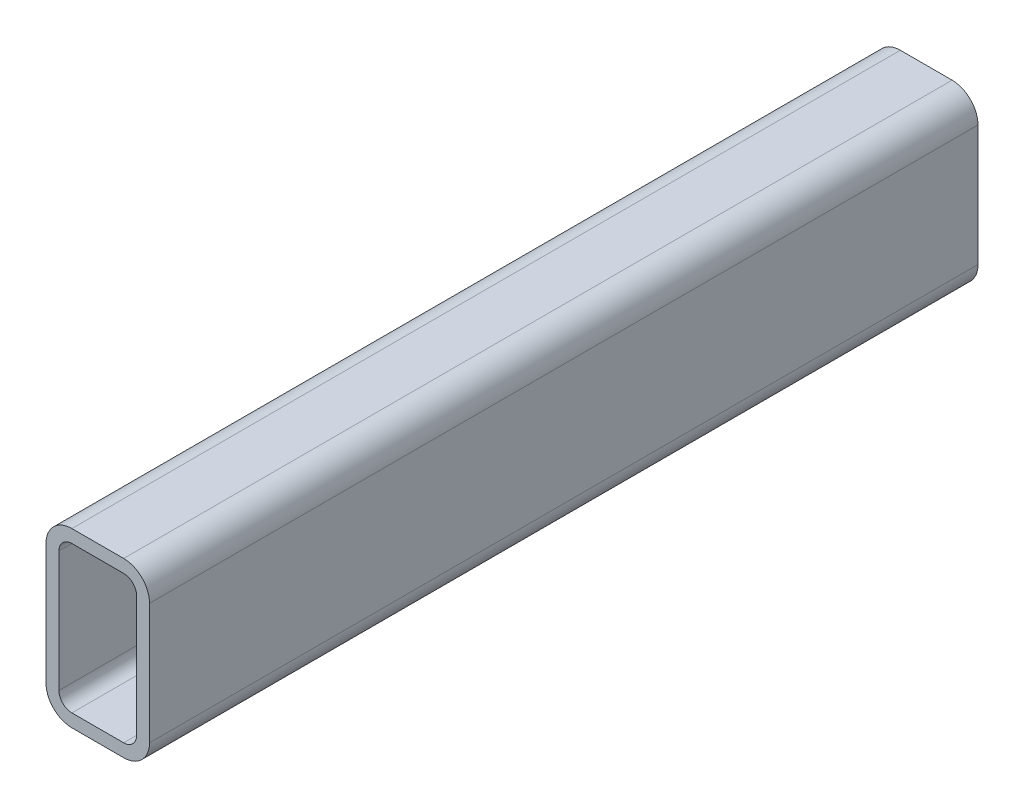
ISO-10303-21;
HEADER;
FILE_DESCRIPTION(('STEP AP214'),'2;1');
FILE_NAME('part.step','',(''),(''),'','','');
FILE_SCHEMA(('AUTOMOTIVE_DESIGN { 1 0 10303 214 1 1 1 1 }'));
ENDSEC;
DATA;
#1=APPLICATION_CONTEXT('core data for automotive mechanical design processes');
#2=APPLICATION_PROTOCOL_DEFINITION('international standard','automotive_design',2000,#1);
#3=PRODUCT_CONTEXT('',#1,'mechanical');
#4=PRODUCT('Part','Part','',(#3));
#5=PRODUCT_RELATED_PRODUCT_CATEGORY('part','',(#4));
#6=PRODUCT_DEFINITION_FORMATION('','',#4);
#7=PRODUCT_DEFINITION_CONTEXT('part definition',#1,'design');
#8=PRODUCT_DEFINITION('design','',#6,#7);
#9=PRODUCT_DEFINITION_SHAPE('','',#8);
#10=(LENGTH_UNIT() NAMED_UNIT(*) SI_UNIT(.MILLI.,.METRE.));
#11=(NAMED_UNIT(*) PLANE_ANGLE_UNIT() SI_UNIT($,.RADIAN.));
#12=(NAMED_UNIT(*) SI_UNIT($,.STERADIAN.) SOLID_ANGLE_UNIT());
#13=UNCERTAINTY_MEASURE_WITH_UNIT(LENGTH_MEASURE(1.E-05),#10,'distance_accuracy_value','');
#14=(GEOMETRIC_REPRESENTATION_CONTEXT(3) GLOBAL_UNCERTAINTY_ASSIGNED_CONTEXT((#13)) GLOBAL_UNIT_ASSIGNED_CONTEXT((#10,
#11,#12)) REPRESENTATION_CONTEXT('',''));
#15=CARTESIAN_POINT('',(0.,0.,0.));
#16=DIRECTION('',(0.,0.,1.));
#17=DIRECTION('',(1.,0.,0.));
#18=AXIS2_PLACEMENT_3D('',#15,#16,#17);
#19=CARTESIAN_POINT('',(9.525,53.975,304.8));
#20=DIRECTION('',(0.,0.,1.));
#21=DIRECTION('',(1.,0.,0.));
#22=AXIS2_PLACEMENT_3D('',#19,#20,#21);
#23=PLANE('',#22);
#24=CARTESIAN_POINT('',(9.525,53.975,304.8));
#25=DIRECTION('',(0.,0.,1.));
#26=DIRECTION('',(1.,0.,0.));
#27=AXIS2_PLACEMENT_3D('',#24,#25,#26);
#28=CIRCLE('',#27,9.525);
#29=CARTESIAN_POINT('',(9.525,63.5,304.8));
#30=VERTEX_POINT('',#29);
#31=CARTESIAN_POINT('',(0.,53.975,304.8));
#32=VERTEX_POINT('',#31);
#33=EDGE_CURVE('E211',#30,#32,#28,.T.);
#34=ORIENTED_EDGE('',*,*,#33,.T.);
#35=DIRECTION('',(0.,-1.,0.));
#36=VECTOR('',#35,1.);
#37=CARTESIAN_POINT('',(0.,9.525,304.8));
#38=LINE('',#37,#36);
#39=CARTESIAN_POINT('',(0.,9.525,304.8));
#40=VERTEX_POINT('',#39);
#41=EDGE_CURVE('E214',#32,#40,#38,.T.);
#42=ORIENTED_EDGE('',*,*,#41,.T.);
#43=CARTESIAN_POINT('',(9.525,9.525,304.8));
#44=DIRECTION('',(0.,0.,1.));
#45=DIRECTION('',(1.,0.,0.));
#46=AXIS2_PLACEMENT_3D('',#43,#44,#45);
#47=CIRCLE('',#46,9.525);
#48=CARTESIAN_POINT('',(9.525,0.,304.8));
#49=VERTEX_POINT('',#48);
#50=EDGE_CURVE('E217',#40,#49,#47,.T.);
#51=ORIENTED_EDGE('',*,*,#50,.T.);
#52=DIRECTION('',(1.,0.,0.));
#53=VECTOR('',#52,1.);
#54=CARTESIAN_POINT('',(28.575,0.,304.8));
#55=LINE('',#54,#53);
#56=CARTESIAN_POINT('',(28.575,0.,304.8));
#57=VERTEX_POINT('',#56);
#58=EDGE_CURVE('E219',#49,#57,#55,.T.);
#59=ORIENTED_EDGE('',*,*,#58,.T.);
#60=CARTESIAN_POINT('',(28.575,9.525,304.8));
#61=DIRECTION('',(0.,0.,1.));
#62=DIRECTION('',(1.,0.,0.));
#63=AXIS2_PLACEMENT_3D('',#60,#61,#62);
#64=CIRCLE('',#63,9.525);
#65=CARTESIAN_POINT('',(38.1,9.525,304.8));
#66=VERTEX_POINT('',#65);
#67=EDGE_CURVE('E221',#57,#66,#64,.T.);
#68=ORIENTED_EDGE('',*,*,#67,.T.);
#69=DIRECTION('',(0.,1.,0.));
#70=VECTOR('',#69,1.);
#71=CARTESIAN_POINT('',(38.1,53.975,304.8));
#72=LINE('',#71,#70);
#73=CARTESIAN_POINT('',(38.1,53.975,304.8));
#74=VERTEX_POINT('',#73);
#75=EDGE_CURVE('E223',#66,#74,#72,.T.);
#76=ORIENTED_EDGE('',*,*,#75,.T.);
#77=CARTESIAN_POINT('',(28.575,53.975,304.8));
#78=DIRECTION('',(0.,0.,1.));
#79=DIRECTION('',(1.,0.,0.));
#80=AXIS2_PLACEMENT_3D('',#77,#78,#79);
#81=CIRCLE('',#80,9.525);
#82=CARTESIAN_POINT('',(28.575,63.5,304.8));
#83=VERTEX_POINT('',#82);
#84=EDGE_CURVE('E225',#74,#83,#81,.T.);
#85=ORIENTED_EDGE('',*,*,#84,.T.);
#86=DIRECTION('',(-1.,0.,0.));
#87=VECTOR('',#86,1.);
#88=CARTESIAN_POINT('',(9.525,63.5,304.8));
#89=LINE('',#88,#87);
#90=EDGE_CURVE('E227',#83,#30,#89,.T.);
#91=ORIENTED_EDGE('',*,*,#90,.T.);
#92=EDGE_LOOP('',(#34,#42,#51,#59,#68,#76,#85,#91));
#93=FACE_BOUND('',#92,.T.);
#94=DIRECTION('',(0.,-1.,0.));
#95=VECTOR('',#94,1.);
#96=CARTESIAN_POINT('',(4.7625,9.525,304.8));
#97=LINE('',#96,#95);
#98=CARTESIAN_POINT('',(4.7625,53.975,304.8));
#99=VERTEX_POINT('',#98);
#100=CARTESIAN_POINT('',(4.7625,9.525,304.8));
#101=VERTEX_POINT('',#100);
#102=EDGE_CURVE('E154',#99,#101,#97,.T.);
#103=ORIENTED_EDGE('',*,*,#102,.F.);
#104=CARTESIAN_POINT('',(9.525,53.975,304.8));
#105=DIRECTION('',(0.,0.,1.));
#106=DIRECTION('',(1.,0.,0.));
#107=AXIS2_PLACEMENT_3D('',#104,#105,#106);
#108=CIRCLE('',#107,4.76249999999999);
#109=CARTESIAN_POINT('',(9.525,58.7375,304.8));
#110=VERTEX_POINT('',#109);
#111=EDGE_CURVE('E146',#110,#99,#108,.T.);
#112=ORIENTED_EDGE('',*,*,#111,.F.);
#113=DIRECTION('',(-1.,0.,0.));
#114=VECTOR('',#113,1.);
#115=CARTESIAN_POINT('',(9.525,58.7375,304.8));
#116=LINE('',#115,#114);
#117=CARTESIAN_POINT('',(28.575,58.7375,304.8));
#118=VERTEX_POINT('',#117);
#119=EDGE_CURVE('E179',#118,#110,#116,.T.);
#120=ORIENTED_EDGE('',*,*,#119,.F.);
#121=CARTESIAN_POINT('',(28.575,53.975,304.8));
#122=DIRECTION('',(0.,0.,1.));
#123=DIRECTION('',(1.,0.,0.));
#124=AXIS2_PLACEMENT_3D('',#121,#122,#123);
#125=CIRCLE('',#124,4.76249999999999);
#126=CARTESIAN_POINT('',(33.3375,53.975,304.8));
#127=VERTEX_POINT('',#126);
#128=EDGE_CURVE('E177',#127,#118,#125,.T.);
#129=ORIENTED_EDGE('',*,*,#128,.F.);
#130=DIRECTION('',(0.,1.,0.));
#131=VECTOR('',#130,1.);
#132=CARTESIAN_POINT('',(33.3375,53.975,304.8));
#133=LINE('',#132,#131);
#134=CARTESIAN_POINT('',(33.3375,9.525,304.8));
#135=VERTEX_POINT('',#134);
#136=EDGE_CURVE('E175',#135,#127,#133,.T.);
#137=ORIENTED_EDGE('',*,*,#136,.F.);
#138=CARTESIAN_POINT('',(28.575,9.525,304.8));
#139=DIRECTION('',(0.,0.,1.));
#140=DIRECTION('',(1.,0.,0.));
#141=AXIS2_PLACEMENT_3D('',#138,#139,#140);
#142=CIRCLE('',#141,4.7625);
#143=CARTESIAN_POINT('',(28.575,4.7625,304.8));
#144=VERTEX_POINT('',#143);
#145=EDGE_CURVE('E173',#144,#135,#142,.T.);
#146=ORIENTED_EDGE('',*,*,#145,.F.);
#147=DIRECTION('',(1.,0.,0.));
#148=VECTOR('',#147,1.);
#149=CARTESIAN_POINT('',(28.575,4.7625,304.8));
#150=LINE('',#149,#148);
#151=CARTESIAN_POINT('',(9.525,4.7625,304.8));
#152=VERTEX_POINT('',#151);
#153=EDGE_CURVE('E169',#152,#144,#150,.T.);
#154=ORIENTED_EDGE('',*,*,#153,.F.);
#155=CARTESIAN_POINT('',(9.525,9.525,304.8));
#156=DIRECTION('',(0.,0.,1.));
#157=DIRECTION('',(1.,0.,0.));
#158=AXIS2_PLACEMENT_3D('',#155,#156,#157);
#159=CIRCLE('',#158,4.7625);
#160=EDGE_CURVE('E167',#101,#152,#159,.T.);
#161=ORIENTED_EDGE('',*,*,#160,.F.);
#162=EDGE_LOOP('',(#103,#112,#120,#129,#137,#146,#154,#161));
#163=FACE_BOUND('',#162,.T.);
#164=ADVANCED_FACE('F33',(#93,#163),#23,.T.);
#165=CARTESIAN_POINT('',(9.525,53.975,0.));
#166=DIRECTION('',(0.,0.,1.));
#167=DIRECTION('',(1.,0.,0.));
#168=AXIS2_PLACEMENT_3D('',#165,#166,#167);
#169=PLANE('',#168);
#170=CARTESIAN_POINT('',(9.525,53.975,0.));
#171=DIRECTION('',(0.,0.,1.));
#172=DIRECTION('',(1.,0.,0.));
#173=AXIS2_PLACEMENT_3D('',#170,#171,#172);
#174=CIRCLE('',#173,9.525);
#175=CARTESIAN_POINT('',(9.525,63.5,0.));
#176=VERTEX_POINT('',#175);
#177=CARTESIAN_POINT('',(0.,53.975,0.));
#178=VERTEX_POINT('',#177);
#179=EDGE_CURVE('E162',#176,#178,#174,.T.);
#180=ORIENTED_EDGE('',*,*,#179,.F.);
#181=DIRECTION('',(-1.,0.,0.));
#182=VECTOR('',#181,1.);
#183=CARTESIAN_POINT('',(9.525,63.5,0.));
#184=LINE('',#183,#182);
#185=CARTESIAN_POINT('',(28.575,63.5,0.));
#186=VERTEX_POINT('',#185);
#187=EDGE_CURVE('E215',#186,#176,#184,.T.);
#188=ORIENTED_EDGE('',*,*,#187,.F.);
#189=CARTESIAN_POINT('',(28.575,53.975,0.));
#190=DIRECTION('',(0.,0.,1.));
#191=DIRECTION('',(1.,0.,0.));
#192=AXIS2_PLACEMENT_3D('',#189,#190,#191);
#193=CIRCLE('',#192,9.525);
#194=CARTESIAN_POINT('',(38.1,53.975,0.));
#195=VERTEX_POINT('',#194);
#196=EDGE_CURVE('E242',#195,#186,#193,.T.);
#197=ORIENTED_EDGE('',*,*,#196,.F.);
#198=DIRECTION('',(0.,1.,0.));
#199=VECTOR('',#198,1.);
#200=CARTESIAN_POINT('',(38.1,53.975,0.));
#201=LINE('',#200,#199);
#202=CARTESIAN_POINT('',(38.1,9.525,0.));
#203=VERTEX_POINT('',#202);
#204=EDGE_CURVE('E240',#203,#195,#201,.T.);
#205=ORIENTED_EDGE('',*,*,#204,.F.);
#206=CARTESIAN_POINT('',(28.575,9.525,0.));
#207=DIRECTION('',(0.,0.,1.));
#208=DIRECTION('',(1.,0.,0.));
#209=AXIS2_PLACEMENT_3D('',#206,#207,#208);
#210=CIRCLE('',#209,9.525);
#211=CARTESIAN_POINT('',(28.575,0.,0.));
#212=VERTEX_POINT('',#211);
#213=EDGE_CURVE('E238',#212,#203,#210,.T.);
#214=ORIENTED_EDGE('',*,*,#213,.F.);
#215=DIRECTION('',(1.,0.,0.));
#216=VECTOR('',#215,1.);
#217=CARTESIAN_POINT('',(28.575,0.,0.));
#218=LINE('',#217,#216);
#219=CARTESIAN_POINT('',(9.525,0.,0.));
#220=VERTEX_POINT('',#219);
#221=EDGE_CURVE('E236',#220,#212,#218,.T.);
#222=ORIENTED_EDGE('',*,*,#221,.F.);
#223=CARTESIAN_POINT('',(9.525,9.525,0.));
#224=DIRECTION('',(0.,0.,1.));
#225=DIRECTION('',(1.,0.,0.));
#226=AXIS2_PLACEMENT_3D('',#223,#224,#225);
#227=CIRCLE('',#226,9.525);
#228=CARTESIAN_POINT('',(0.,9.525,0.));
#229=VERTEX_POINT('',#228);
#230=EDGE_CURVE('E234',#229,#220,#227,.T.);
#231=ORIENTED_EDGE('',*,*,#230,.F.);
#232=DIRECTION('',(0.,-1.,0.));
#233=VECTOR('',#232,1.);
#234=CARTESIAN_POINT('',(0.,9.525,0.));
#235=LINE('',#234,#233);
#236=EDGE_CURVE('E232',#178,#229,#235,.T.);
#237=ORIENTED_EDGE('',*,*,#236,.F.);
#238=EDGE_LOOP('',(#180,#188,#197,#205,#214,#222,#231,#237));
#239=FACE_BOUND('',#238,.T.);
#240=CARTESIAN_POINT('',(9.525,53.975,0.));
#241=DIRECTION('',(0.,0.,1.));
#242=DIRECTION('',(1.,0.,0.));
#243=AXIS2_PLACEMENT_3D('',#240,#241,#242);
#244=CIRCLE('',#243,4.76249999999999);
#245=CARTESIAN_POINT('',(9.525,58.7375,0.));
#246=VERTEX_POINT('',#245);
#247=CARTESIAN_POINT('',(4.7625,53.975,0.));
#248=VERTEX_POINT('',#247);
#249=EDGE_CURVE('E56',#246,#248,#244,.T.);
#250=ORIENTED_EDGE('',*,*,#249,.T.);
#251=DIRECTION('',(0.,-1.,0.));
#252=VECTOR('',#251,1.);
#253=CARTESIAN_POINT('',(4.7625,9.525,0.));
#254=LINE('',#253,#252);
#255=CARTESIAN_POINT('',(4.7625,9.525,0.));
#256=VERTEX_POINT('',#255);
#257=EDGE_CURVE('E161',#248,#256,#254,.T.);
#258=ORIENTED_EDGE('',*,*,#257,.T.);
#259=CARTESIAN_POINT('',(9.525,9.525,0.));
#260=DIRECTION('',(0.,0.,1.));
#261=DIRECTION('',(1.,0.,0.));
#262=AXIS2_PLACEMENT_3D('',#259,#260,#261);
#263=CIRCLE('',#262,4.7625);
#264=CARTESIAN_POINT('',(9.525,4.7625,0.));
#265=VERTEX_POINT('',#264);
#266=EDGE_CURVE('E183',#256,#265,#263,.T.);
#267=ORIENTED_EDGE('',*,*,#266,.T.);
#268=DIRECTION('',(1.,0.,0.));
#269=VECTOR('',#268,1.);
#270=CARTESIAN_POINT('',(28.575,4.7625,0.));
#271=LINE('',#270,#269);
#272=CARTESIAN_POINT('',(28.575,4.7625,0.));
#273=VERTEX_POINT('',#272);
#274=EDGE_CURVE('E186',#265,#273,#271,.T.);
#275=ORIENTED_EDGE('',*,*,#274,.T.);
#276=CARTESIAN_POINT('',(28.575,9.525,0.));
#277=DIRECTION('',(0.,0.,1.));
#278=DIRECTION('',(1.,0.,0.));
#279=AXIS2_PLACEMENT_3D('',#276,#277,#278);
#280=CIRCLE('',#279,4.7625);
#281=CARTESIAN_POINT('',(33.3375,9.525,0.));
#282=VERTEX_POINT('',#281);
#283=EDGE_CURVE('E189',#273,#282,#280,.T.);
#284=ORIENTED_EDGE('',*,*,#283,.T.);
#285=DIRECTION('',(0.,1.,0.));
#286=VECTOR('',#285,1.);
#287=CARTESIAN_POINT('',(33.3375,53.975,0.));
#288=LINE('',#287,#286);
#289=CARTESIAN_POINT('',(33.3375,53.975,0.));
#290=VERTEX_POINT('',#289);
#291=EDGE_CURVE('E192',#282,#290,#288,.T.);
#292=ORIENTED_EDGE('',*,*,#291,.T.);
#293=CARTESIAN_POINT('',(28.575,53.975,0.));
#294=DIRECTION('',(0.,0.,1.));
#295=DIRECTION('',(1.,0.,0.));
#296=AXIS2_PLACEMENT_3D('',#293,#294,#295);
#297=CIRCLE('',#296,4.76249999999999);
#298=CARTESIAN_POINT('',(28.575,58.7375,0.));
#299=VERTEX_POINT('',#298);
#300=EDGE_CURVE('E195',#290,#299,#297,.T.);
#301=ORIENTED_EDGE('',*,*,#300,.T.);
#302=DIRECTION('',(-1.,0.,0.));
#303=VECTOR('',#302,1.);
#304=CARTESIAN_POINT('',(9.525,58.7375,0.));
#305=LINE('',#304,#303);
#306=EDGE_CURVE('E155',#299,#246,#305,.T.);
#307=ORIENTED_EDGE('',*,*,#306,.T.);
#308=EDGE_LOOP('',(#250,#258,#267,#275,#284,#292,#301,#307));
#309=FACE_BOUND('',#308,.T.);
#310=ADVANCED_FACE('F272',(#239,#309),#169,.F.);
#311=CARTESIAN_POINT('',(9.525,53.975,304.8));
#312=DIRECTION('',(0.,0.,-1.));
#313=DIRECTION('',(-1.,0.,0.));
#314=AXIS2_PLACEMENT_3D('',#311,#312,#313);
#315=CYLINDRICAL_SURFACE('',#314,9.525);
#316=ORIENTED_EDGE('',*,*,#179,.T.);
#317=DIRECTION('',(0.,0.,-1.));
#318=VECTOR('',#317,1.);
#319=CARTESIAN_POINT('',(0.,53.975,304.8));
#320=LINE('',#319,#318);
#321=EDGE_CURVE('E11',#32,#178,#320,.T.);
#322=ORIENTED_EDGE('',*,*,#321,.F.);
#323=ORIENTED_EDGE('',*,*,#33,.F.);
#324=DIRECTION('',(0.,0.,-1.));
#325=VECTOR('',#324,1.);
#326=CARTESIAN_POINT('',(9.525,63.5,304.8));
#327=LINE('',#326,#325);
#328=EDGE_CURVE('E229',#30,#176,#327,.T.);
#329=ORIENTED_EDGE('',*,*,#328,.T.);
#330=EDGE_LOOP('',(#316,#322,#323,#329));
#331=FACE_BOUND('',#330,.T.);
#332=ADVANCED_FACE('F35',(#331),#315,.T.);
#333=CARTESIAN_POINT('',(0.,9.525,304.8));
#334=DIRECTION('',(1.,0.,0.));
#335=DIRECTION('',(0.,0.,-1.));
#336=AXIS2_PLACEMENT_3D('',#333,#334,#335);
#337=PLANE('',#336);
#338=ORIENTED_EDGE('',*,*,#236,.T.);
#339=DIRECTION('',(0.,0.,-1.));
#340=VECTOR('',#339,1.);
#341=CARTESIAN_POINT('',(0.,9.525,304.8));
#342=LINE('',#341,#340);
#343=EDGE_CURVE('E41',#40,#229,#342,.T.);
#344=ORIENTED_EDGE('',*,*,#343,.F.);
#345=ORIENTED_EDGE('',*,*,#41,.F.);
#346=ORIENTED_EDGE('',*,*,#321,.T.);
#347=EDGE_LOOP('',(#338,#344,#345,#346));
#348=FACE_BOUND('',#347,.T.);
#349=ADVANCED_FACE('F289',(#348),#337,.F.);
#350=CARTESIAN_POINT('',(9.525,9.525,304.8));
#351=DIRECTION('',(0.,0.,-1.));
#352=DIRECTION('',(-1.,0.,0.));
#353=AXIS2_PLACEMENT_3D('',#350,#351,#352);
#354=CYLINDRICAL_SURFACE('',#353,9.525);
#355=ORIENTED_EDGE('',*,*,#230,.T.);
#356=DIRECTION('',(0.,0.,-1.));
#357=VECTOR('',#356,1.);
#358=CARTESIAN_POINT('',(9.525,0.,304.8));
#359=LINE('',#358,#357);
#360=EDGE_CURVE('E259',#49,#220,#359,.T.);
#361=ORIENTED_EDGE('',*,*,#360,.F.);
#362=ORIENTED_EDGE('',*,*,#50,.F.);
#363=ORIENTED_EDGE('',*,*,#343,.T.);
#364=EDGE_LOOP('',(#355,#361,#362,#363));
#365=FACE_BOUND('',#364,.T.);
#366=ADVANCED_FACE('F266',(#365),#354,.T.);
#367=CARTESIAN_POINT('',(28.575,0.,304.8));
#368=DIRECTION('',(0.,1.,0.));
#369=DIRECTION('',(0.,0.,1.));
#370=AXIS2_PLACEMENT_3D('',#367,#368,#369);
#371=PLANE('',#370);
#372=ORIENTED_EDGE('',*,*,#221,.T.);
#373=DIRECTION('',(0.,0.,-1.));
#374=VECTOR('',#373,1.);
#375=CARTESIAN_POINT('',(28.575,0.,304.8));
#376=LINE('',#375,#374);
#377=EDGE_CURVE('E256',#57,#212,#376,.T.);
#378=ORIENTED_EDGE('',*,*,#377,.F.);
#379=ORIENTED_EDGE('',*,*,#58,.F.);
#380=ORIENTED_EDGE('',*,*,#360,.T.);
#381=EDGE_LOOP('',(#372,#378,#379,#380));
#382=FACE_BOUND('',#381,.T.);
#383=ADVANCED_FACE('F278',(#382),#371,.F.);
#384=CARTESIAN_POINT('',(28.575,9.525,304.8));
#385=DIRECTION('',(0.,0.,-1.));
#386=DIRECTION('',(-1.,0.,0.));
#387=AXIS2_PLACEMENT_3D('',#384,#385,#386);
#388=CYLINDRICAL_SURFACE('',#387,9.525);
#389=ORIENTED_EDGE('',*,*,#213,.T.);
#390=DIRECTION('',(0.,0.,-1.));
#391=VECTOR('',#390,1.);
#392=CARTESIAN_POINT('',(38.1,9.525,304.8));
#393=LINE('',#392,#391);
#394=EDGE_CURVE('E253',#66,#203,#393,.T.);
#395=ORIENTED_EDGE('',*,*,#394,.F.);
#396=ORIENTED_EDGE('',*,*,#67,.F.);
#397=ORIENTED_EDGE('',*,*,#377,.T.);
#398=EDGE_LOOP('',(#389,#395,#396,#397));
#399=FACE_BOUND('',#398,.T.);
#400=ADVANCED_FACE('F282',(#399),#388,.T.);
#401=CARTESIAN_POINT('',(38.1,53.975,304.8));
#402=DIRECTION('',(-1.,0.,0.));
#403=DIRECTION('',(0.,0.,1.));
#404=AXIS2_PLACEMENT_3D('',#401,#402,#403);
#405=PLANE('',#404);
#406=ORIENTED_EDGE('',*,*,#204,.T.);
#407=DIRECTION('',(0.,0.,-1.));
#408=VECTOR('',#407,1.);
#409=CARTESIAN_POINT('',(38.1,53.975,304.8));
#410=LINE('',#409,#408);
#411=EDGE_CURVE('E250',#74,#195,#410,.T.);
#412=ORIENTED_EDGE('',*,*,#411,.F.);
#413=ORIENTED_EDGE('',*,*,#75,.F.);
#414=ORIENTED_EDGE('',*,*,#394,.T.);
#415=EDGE_LOOP('',(#406,#412,#413,#414));
#416=FACE_BOUND('',#415,.T.);
#417=ADVANCED_FACE('F302',(#416),#405,.F.);
#418=CARTESIAN_POINT('',(28.575,53.975,304.8));
#419=DIRECTION('',(0.,0.,-1.));
#420=DIRECTION('',(-1.,0.,0.));
#421=AXIS2_PLACEMENT_3D('',#418,#419,#420);
#422=CYLINDRICAL_SURFACE('',#421,9.525);
#423=ORIENTED_EDGE('',*,*,#196,.T.);
#424=DIRECTION('',(0.,0.,-1.));
#425=VECTOR('',#424,1.);
#426=CARTESIAN_POINT('',(28.575,63.5,304.8));
#427=LINE('',#426,#425);
#428=EDGE_CURVE('E247',#83,#186,#427,.T.);
#429=ORIENTED_EDGE('',*,*,#428,.F.);
#430=ORIENTED_EDGE('',*,*,#84,.F.);
#431=ORIENTED_EDGE('',*,*,#411,.T.);
#432=EDGE_LOOP('',(#423,#429,#430,#431));
#433=FACE_BOUND('',#432,.T.);
#434=ADVANCED_FACE('F300',(#433),#422,.T.);
#435=CARTESIAN_POINT('',(9.525,63.5,304.8));
#436=DIRECTION('',(0.,-1.,0.));
#437=DIRECTION('',(0.,0.,-1.));
#438=AXIS2_PLACEMENT_3D('',#435,#436,#437);
#439=PLANE('',#438);
#440=ORIENTED_EDGE('',*,*,#187,.T.);
#441=ORIENTED_EDGE('',*,*,#328,.F.);
#442=ORIENTED_EDGE('',*,*,#90,.F.);
#443=ORIENTED_EDGE('',*,*,#428,.T.);
#444=EDGE_LOOP('',(#440,#441,#442,#443));
#445=FACE_BOUND('',#444,.T.);
#446=ADVANCED_FACE('F295',(#445),#439,.F.);
#447=CARTESIAN_POINT('',(9.525,53.975,304.8));
#448=DIRECTION('',(0.,0.,-1.));
#449=DIRECTION('',(-1.,0.,0.));
#450=AXIS2_PLACEMENT_3D('',#447,#448,#449);
#451=CYLINDRICAL_SURFACE('',#450,4.76249999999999);
#452=ORIENTED_EDGE('',*,*,#249,.F.);
#453=DIRECTION('',(0.,0.,-1.));
#454=VECTOR('',#453,1.);
#455=CARTESIAN_POINT('',(9.525,58.7375,304.8));
#456=LINE('',#455,#454);
#457=EDGE_CURVE('E150',#110,#246,#456,.T.);
#458=ORIENTED_EDGE('',*,*,#457,.F.);
#459=ORIENTED_EDGE('',*,*,#111,.T.);
#460=DIRECTION('',(0.,0.,-1.));
#461=VECTOR('',#460,1.);
#462=CARTESIAN_POINT('',(4.7625,53.975,304.8));
#463=LINE('',#462,#461);
#464=EDGE_CURVE('E149',#99,#248,#463,.T.);
#465=ORIENTED_EDGE('',*,*,#464,.T.);
#466=EDGE_LOOP('',(#452,#458,#459,#465));
#467=FACE_BOUND('',#466,.T.);
#468=ADVANCED_FACE('F148',(#467),#451,.F.);
#469=CARTESIAN_POINT('',(4.7625,9.525,304.8));
#470=DIRECTION('',(1.,0.,0.));
#471=DIRECTION('',(0.,0.,-1.));
#472=AXIS2_PLACEMENT_3D('',#469,#470,#471);
#473=PLANE('',#472);
#474=ORIENTED_EDGE('',*,*,#257,.F.);
#475=ORIENTED_EDGE('',*,*,#464,.F.);
#476=ORIENTED_EDGE('',*,*,#102,.T.);
#477=DIRECTION('',(0.,0.,-1.));
#478=VECTOR('',#477,1.);
#479=CARTESIAN_POINT('',(4.7625,9.525,304.8));
#480=LINE('',#479,#478);
#481=EDGE_CURVE('E163',#101,#256,#480,.T.);
#482=ORIENTED_EDGE('',*,*,#481,.T.);
#483=EDGE_LOOP('',(#474,#475,#476,#482));
#484=FACE_BOUND('',#483,.T.);
#485=ADVANCED_FACE('F158',(#484),#473,.T.);
#486=CARTESIAN_POINT('',(9.525,9.525,304.8));
#487=DIRECTION('',(0.,0.,-1.));
#488=DIRECTION('',(-1.,0.,0.));
#489=AXIS2_PLACEMENT_3D('',#486,#487,#488);
#490=CYLINDRICAL_SURFACE('',#489,4.7625);
#491=ORIENTED_EDGE('',*,*,#266,.F.);
#492=ORIENTED_EDGE('',*,*,#481,.F.);
#493=ORIENTED_EDGE('',*,*,#160,.T.);
#494=DIRECTION('',(0.,0.,-1.));
#495=VECTOR('',#494,1.);
#496=CARTESIAN_POINT('',(9.525,4.7625,304.8));
#497=LINE('',#496,#495);
#498=EDGE_CURVE('E208',#152,#265,#497,.T.);
#499=ORIENTED_EDGE('',*,*,#498,.T.);
#500=EDGE_LOOP('',(#491,#492,#493,#499));
#501=FACE_BOUND('',#500,.T.);
#502=ADVANCED_FACE('F327',(#501),#490,.F.);
#503=CARTESIAN_POINT('',(28.575,4.7625,304.8));
#504=DIRECTION('',(0.,1.,0.));
#505=DIRECTION('',(0.,0.,1.));
#506=AXIS2_PLACEMENT_3D('',#503,#504,#505);
#507=PLANE('',#506);
#508=ORIENTED_EDGE('',*,*,#274,.F.);
#509=ORIENTED_EDGE('',*,*,#498,.F.);
#510=ORIENTED_EDGE('',*,*,#153,.T.);
#511=DIRECTION('',(0.,0.,-1.));
#512=VECTOR('',#511,1.);
#513=CARTESIAN_POINT('',(28.575,4.7625,304.8));
#514=LINE('',#513,#512);
#515=EDGE_CURVE('E206',#144,#273,#514,.T.);
#516=ORIENTED_EDGE('',*,*,#515,.T.);
#517=EDGE_LOOP('',(#508,#509,#510,#516));
#518=FACE_BOUND('',#517,.T.);
#519=ADVANCED_FACE('F331',(#518),#507,.T.);
#520=CARTESIAN_POINT('',(28.575,9.525,304.8));
#521=DIRECTION('',(0.,0.,-1.));
#522=DIRECTION('',(-1.,0.,0.));
#523=AXIS2_PLACEMENT_3D('',#520,#521,#522);
#524=CYLINDRICAL_SURFACE('',#523,4.7625);
#525=ORIENTED_EDGE('',*,*,#283,.F.);
#526=ORIENTED_EDGE('',*,*,#515,.F.);
#527=ORIENTED_EDGE('',*,*,#145,.T.);
#528=DIRECTION('',(0.,0.,-1.));
#529=VECTOR('',#528,1.);
#530=CARTESIAN_POINT('',(33.3375,9.525,304.8));
#531=LINE('',#530,#529);
#532=EDGE_CURVE('E204',#135,#282,#531,.T.);
#533=ORIENTED_EDGE('',*,*,#532,.T.);
#534=EDGE_LOOP('',(#525,#526,#527,#533));
#535=FACE_BOUND('',#534,.T.);
#536=ADVANCED_FACE('F337',(#535),#524,.F.);
#537=CARTESIAN_POINT('',(33.3375,53.975,304.8));
#538=DIRECTION('',(-1.,0.,0.));
#539=DIRECTION('',(0.,0.,1.));
#540=AXIS2_PLACEMENT_3D('',#537,#538,#539);
#541=PLANE('',#540);
#542=ORIENTED_EDGE('',*,*,#291,.F.);
#543=ORIENTED_EDGE('',*,*,#532,.F.);
#544=ORIENTED_EDGE('',*,*,#136,.T.);
#545=DIRECTION('',(0.,0.,-1.));
#546=VECTOR('',#545,1.);
#547=CARTESIAN_POINT('',(33.3375,53.975,304.8));
#548=LINE('',#547,#546);
#549=EDGE_CURVE('E202',#127,#290,#548,.T.);
#550=ORIENTED_EDGE('',*,*,#549,.T.);
#551=EDGE_LOOP('',(#542,#543,#544,#550));
#552=FACE_BOUND('',#551,.T.);
#553=ADVANCED_FACE('F341',(#552),#541,.T.);
#554=CARTESIAN_POINT('',(28.575,53.975,304.8));
#555=DIRECTION('',(0.,0.,-1.));
#556=DIRECTION('',(-1.,0.,0.));
#557=AXIS2_PLACEMENT_3D('',#554,#555,#556);
#558=CYLINDRICAL_SURFACE('',#557,4.76249999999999);
#559=ORIENTED_EDGE('',*,*,#300,.F.);
#560=ORIENTED_EDGE('',*,*,#549,.F.);
#561=ORIENTED_EDGE('',*,*,#128,.T.);
#562=DIRECTION('',(0.,0.,-1.));
#563=VECTOR('',#562,1.);
#564=CARTESIAN_POINT('',(28.575,58.7375,304.8));
#565=LINE('',#564,#563);
#566=EDGE_CURVE('E48',#118,#299,#565,.T.);
#567=ORIENTED_EDGE('',*,*,#566,.T.);
#568=EDGE_LOOP('',(#559,#560,#561,#567));
#569=FACE_BOUND('',#568,.T.);
#570=ADVANCED_FACE('F345',(#569),#558,.F.);
#571=CARTESIAN_POINT('',(9.525,58.7375,304.8));
#572=DIRECTION('',(0.,-1.,0.));
#573=DIRECTION('',(0.,0.,-1.));
#574=AXIS2_PLACEMENT_3D('',#571,#572,#573);
#575=PLANE('',#574);
#576=ORIENTED_EDGE('',*,*,#306,.F.);
#577=ORIENTED_EDGE('',*,*,#566,.F.);
#578=ORIENTED_EDGE('',*,*,#119,.T.);
#579=ORIENTED_EDGE('',*,*,#457,.T.);
#580=EDGE_LOOP('',(#576,#577,#578,#579));
#581=FACE_BOUND('',#580,.T.);
#582=ADVANCED_FACE('F349',(#581),#575,.T.);
#583=CLOSED_SHELL('',(#164,#310,#332,#349,#366,#383,#400,#417,#434,#446,#468,#485,#502,#519,
#536,#553,#570,#582));
#584=MANIFOLD_SOLID_BREP('B2',#583);
#585=ADVANCED_BREP_SHAPE_REPRESENTATION('',(#18,#584),#14);
#586=SHAPE_DEFINITION_REPRESENTATION(#9,#585);
ENDSEC;
END-ISO-10303-21;
